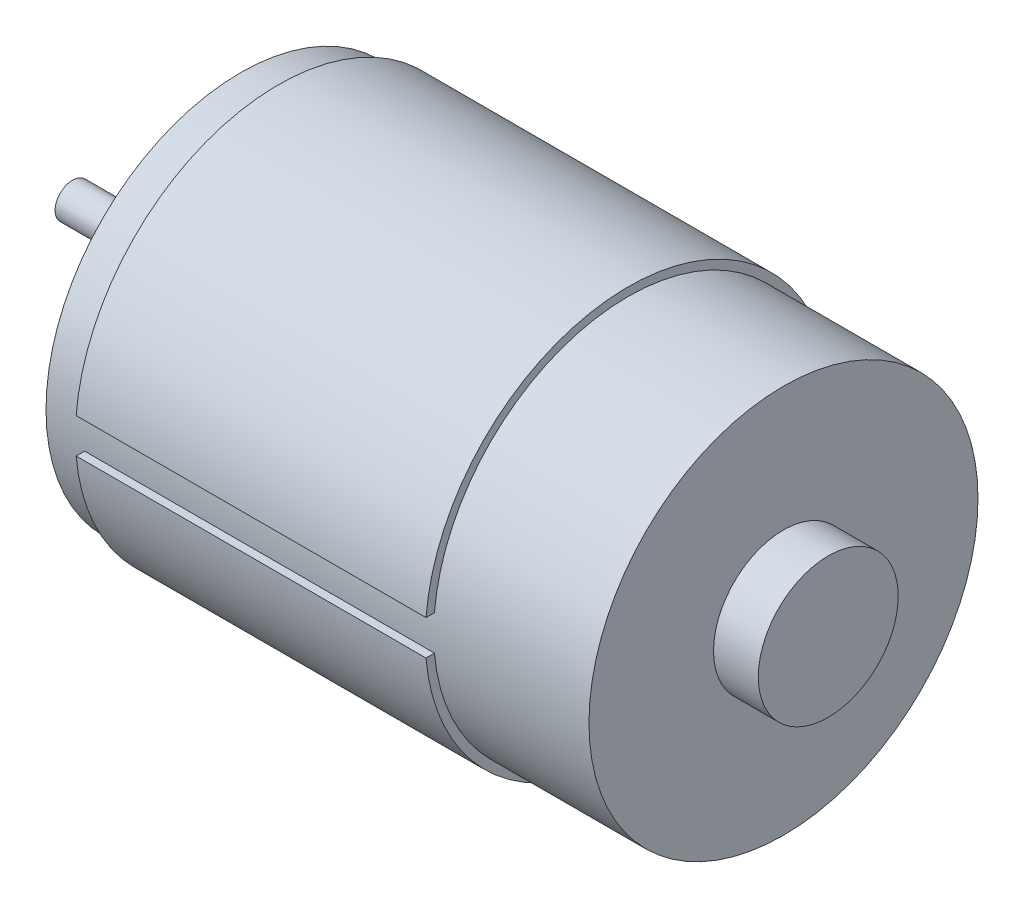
from build123d import *

# Parameters (mm, degrees)
CUT_EXTRUDE1_DEPTH = 58.762444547


with BuildPart() as part:
    # Sketch1 → Revolve1 (revolve)
    with BuildSketch(Plane.XY, mode=Mode.PRIVATE) as revolve1_sk:
        Polygon((0, 0), (0, 1.25), (9.3, 1.25), (9.3, 5), (12, 5), (12, 13.9), (14.7, 13.9), (14.7, 14.5), (39.7, 14.5), (39.7, 13.9), (50.8, 13.9), (50.8, 5), (54, 5), (54, 0), align=None)
    revolve(revolve1_sk.sketch.rotate(Axis((-8.120805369, 0, 0), (1, 0, 0)), 90), axis=Axis((-8.120805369, 0, 0), (1, 0, 0)))

    # Sketch2 → Cut-Extrude1 (cut, through all)
    with BuildSketch(Plane(origin=(0, 0, 0), x_dir=(0, 0, -1), z_dir=(1, 0, 0))):
        with BuildLine():
            Line((-13.843680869, 1.25), (-17.214584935, 1.25))
            Line((-17.214584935, 1.25), (-17.214584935, -1.25))
            Line((-17.214584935, -1.25), (-13.843680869, -1.25))
            ThreePointArc((-13.843680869, -1.25), (-13.9, 0), (-13.843680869, 1.25))
        make_face()
    extrude(amount=CUT_EXTRUDE1_DEPTH, mode=Mode.SUBTRACT)


solid = part.part
